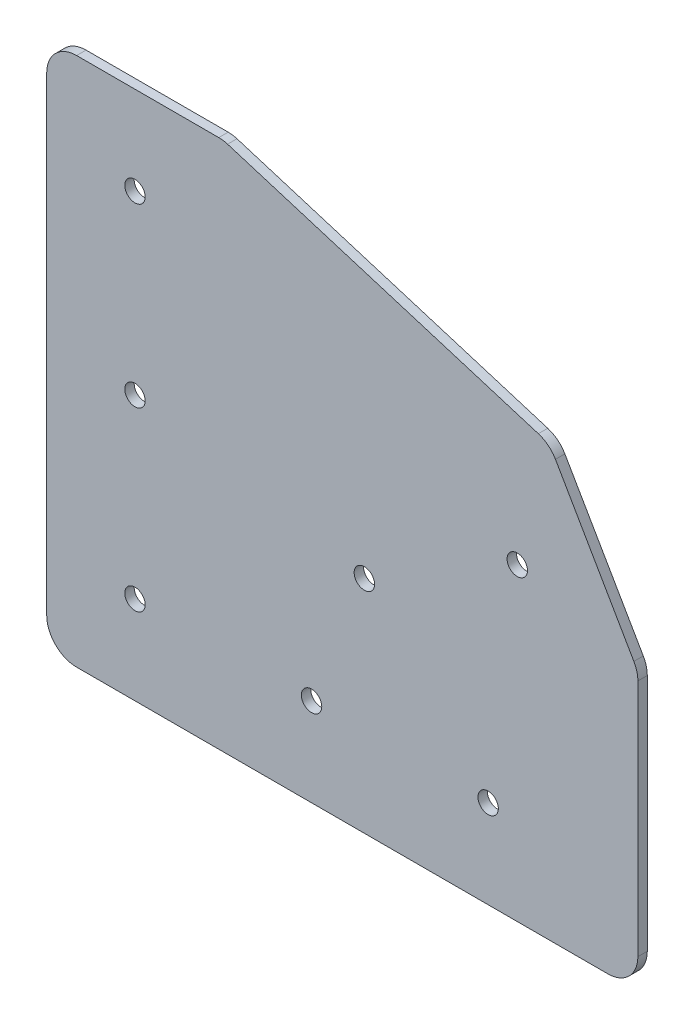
ISO-10303-21;
HEADER;
FILE_DESCRIPTION(('STEP AP214'),'2;1');
FILE_NAME('part.step','',(''),(''),'','','');
FILE_SCHEMA(('AUTOMOTIVE_DESIGN { 1 0 10303 214 1 1 1 1 }'));
ENDSEC;
DATA;
#1=APPLICATION_CONTEXT('core data for automotive mechanical design processes');
#2=APPLICATION_PROTOCOL_DEFINITION('international standard','automotive_design',2000,#1);
#3=PRODUCT_CONTEXT('',#1,'mechanical');
#4=PRODUCT('Part','Part','',(#3));
#5=PRODUCT_RELATED_PRODUCT_CATEGORY('part','',(#4));
#6=PRODUCT_DEFINITION_FORMATION('','',#4);
#7=PRODUCT_DEFINITION_CONTEXT('part definition',#1,'design');
#8=PRODUCT_DEFINITION('design','',#6,#7);
#9=PRODUCT_DEFINITION_SHAPE('','',#8);
#10=(LENGTH_UNIT() NAMED_UNIT(*) SI_UNIT(.MILLI.,.METRE.));
#11=(NAMED_UNIT(*) PLANE_ANGLE_UNIT() SI_UNIT($,.RADIAN.));
#12=(NAMED_UNIT(*) SI_UNIT($,.STERADIAN.) SOLID_ANGLE_UNIT());
#13=UNCERTAINTY_MEASURE_WITH_UNIT(LENGTH_MEASURE(1.E-05),#10,'distance_accuracy_value','');
#14=(GEOMETRIC_REPRESENTATION_CONTEXT(3) GLOBAL_UNCERTAINTY_ASSIGNED_CONTEXT((#13)) GLOBAL_UNIT_ASSIGNED_CONTEXT((#10,
#11,#12)) REPRESENTATION_CONTEXT('',''));
#15=CARTESIAN_POINT('',(0.,0.,0.));
#16=DIRECTION('',(0.,0.,1.));
#17=DIRECTION('',(1.,0.,0.));
#18=AXIS2_PLACEMENT_3D('',#15,#16,#17);
#19=CARTESIAN_POINT('',(95.6712777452,4.841875,1.524));
#20=DIRECTION('',(1.,0.,0.));
#21=DIRECTION('',(0.,0.,-1.));
#22=AXIS2_PLACEMENT_3D('',#19,#20,#21);
#23=PLANE('',#22);
#24=DIRECTION('',(0.,1.,0.));
#25=VECTOR('',#24,1.);
#26=CARTESIAN_POINT('',(95.6712777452,42.8625,1.524));
#27=LINE('',#26,#25);
#28=CARTESIAN_POINT('',(95.6712777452,4.84187499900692,1.524));
#29=VERTEX_POINT('',#28);
#30=CARTESIAN_POINT('',(95.6712777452,43.4792855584,1.524));
#31=VERTEX_POINT('',#30);
#32=EDGE_CURVE('E198',#29,#31,#27,.T.);
#33=ORIENTED_EDGE('',*,*,#32,.F.);
#34=DIRECTION('',(0.,0.,1.));
#35=VECTOR('',#34,1.);
#36=CARTESIAN_POINT('',(95.6712777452,4.84187499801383,0.762));
#37=LINE('',#36,#35);
#38=CARTESIAN_POINT('',(95.6712777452,4.84187499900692,0.));
#39=VERTEX_POINT('',#38);
#40=EDGE_CURVE('E128',#29,#39,#37,.F.);
#41=ORIENTED_EDGE('',*,*,#40,.T.);
#42=DIRECTION('',(0.,1.,0.));
#43=VECTOR('',#42,1.);
#44=CARTESIAN_POINT('',(95.6712777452,42.8625,0.));
#45=LINE('',#44,#43);
#46=CARTESIAN_POINT('',(95.6712777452,43.4792855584,0.));
#47=VERTEX_POINT('',#46);
#48=EDGE_CURVE('E222',#39,#47,#45,.T.);
#49=ORIENTED_EDGE('',*,*,#48,.T.);
#50=DIRECTION('',(0.,0.,-1.));
#51=VECTOR('',#50,1.);
#52=CARTESIAN_POINT('',(95.6712777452,43.4792855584,0.762));
#53=LINE('',#52,#51);
#54=EDGE_CURVE('E158',#47,#31,#53,.F.);
#55=ORIENTED_EDGE('',*,*,#54,.T.);
#56=EDGE_LOOP('',(#33,#41,#49,#55));
#57=FACE_BOUND('',#56,.T.);
#58=ADVANCED_FACE('F15',(#57),#23,.T.);
#59=CARTESIAN_POINT('',(90.8294027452,43.4792855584,0.));
#60=DIRECTION('',(0.,0.,1.));
#61=DIRECTION('',(1.,0.,0.));
#62=AXIS2_PLACEMENT_3D('',#59,#60,#61);
#63=CYLINDRICAL_SURFACE('',#62,4.841875);
#64=ORIENTED_EDGE('',*,*,#54,.F.);
#65=CARTESIAN_POINT('',(90.8294027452,43.4792855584,0.));
#66=DIRECTION('',(0.,0.,1.));
#67=DIRECTION('',(1.,0.,0.));
#68=AXIS2_PLACEMENT_3D('',#65,#66,#67);
#69=CIRCLE('',#68,4.841875);
#70=CARTESIAN_POINT('',(95.0225894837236,45.9002230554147,0.));
#71=VERTEX_POINT('',#70);
#72=EDGE_CURVE('E219',#47,#71,#69,.T.);
#73=ORIENTED_EDGE('',*,*,#72,.T.);
#74=DIRECTION('',(0.,0.,1.));
#75=VECTOR('',#74,1.);
#76=CARTESIAN_POINT('',(95.022589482,45.9002230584,0.762));
#77=LINE('',#76,#75);
#78=CARTESIAN_POINT('',(95.0225894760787,45.9002230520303,1.524));
#79=VERTEX_POINT('',#78);
#80=EDGE_CURVE('E155',#71,#79,#77,.T.);
#81=ORIENTED_EDGE('',*,*,#80,.T.);
#82=CARTESIAN_POINT('',(90.8294027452,43.4792855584,1.524));
#83=DIRECTION('',(0.,0.,1.));
#84=DIRECTION('',(1.,0.,0.));
#85=AXIS2_PLACEMENT_3D('',#82,#83,#84);
#86=CIRCLE('',#85,4.841875);
#87=EDGE_CURVE('E196',#31,#79,#86,.T.);
#88=ORIENTED_EDGE('',*,*,#87,.F.);
#89=EDGE_LOOP('',(#64,#73,#81,#88));
#90=FACE_BOUND('',#89,.T.);
#91=ADVANCED_FACE('F265',(#90),#63,.T.);
#92=CARTESIAN_POINT('',(82.3360453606,67.873962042,0.));
#93=DIRECTION('',(-0.866025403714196,-0.500000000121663,0.));
#94=DIRECTION('',(0.500000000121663,-0.866025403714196,0.));
#95=AXIS2_PLACEMENT_3D('',#92,#93,#94);
#96=PLANE('',#95);
#97=ORIENTED_EDGE('',*,*,#80,.F.);
#98=DIRECTION('',(0.500000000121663,-0.866025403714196,0.));
#99=VECTOR('',#98,1.);
#100=CARTESIAN_POINT('',(82.3360453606,67.873962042,0.));
#101=LINE('',#100,#99);
#102=CARTESIAN_POINT('',(82.3360453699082,67.8739620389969,0.));
#103=VERTEX_POINT('',#102);
#104=EDGE_CURVE('E217',#71,#103,#101,.F.);
#105=ORIENTED_EDGE('',*,*,#104,.T.);
#106=DIRECTION('',(0.,0.,-1.));
#107=VECTOR('',#106,1.);
#108=CARTESIAN_POINT('',(82.3360453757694,67.8739620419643,0.762));
#109=LINE('',#108,#107);
#110=CARTESIAN_POINT('',(82.3360453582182,67.8739620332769,1.524));
#111=VERTEX_POINT('',#110);
#112=EDGE_CURVE('E103',#103,#111,#109,.F.);
#113=ORIENTED_EDGE('',*,*,#112,.T.);
#114=DIRECTION('',(-0.500000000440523,0.866025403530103,0.));
#115=VECTOR('',#114,1.);
#116=CARTESIAN_POINT('',(95.0225894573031,45.900223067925,1.524));
#117=LINE('',#116,#115);
#118=EDGE_CURVE('E194',#79,#111,#117,.T.);
#119=ORIENTED_EDGE('',*,*,#118,.F.);
#120=EDGE_LOOP('',(#97,#105,#113,#119));
#121=FACE_BOUND('',#120,.T.);
#122=ADVANCED_FACE('F268',(#121),#96,.F.);
#123=CARTESIAN_POINT('',(78.1428586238,65.453024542,1.524));
#124=DIRECTION('',(0.,0.,-1.));
#125=DIRECTION('',(0.,1.,0.));
#126=AXIS2_PLACEMENT_3D('',#123,#124,#125);
#127=CYLINDRICAL_SURFACE('',#126,4.84187500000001);
#128=ORIENTED_EDGE('',*,*,#112,.F.);
#129=CARTESIAN_POINT('',(78.1428586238,65.453024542,0.));
#130=DIRECTION('',(0.,0.,-1.));
#131=DIRECTION('',(0.,1.,0.));
#132=AXIS2_PLACEMENT_3D('',#129,#130,#131);
#133=CIRCLE('',#132,4.84187500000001);
#134=CARTESIAN_POINT('',(79.5630061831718,70.0819482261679,0.));
#135=VERTEX_POINT('',#134);
#136=EDGE_CURVE('E19',#103,#135,#133,.F.);
#137=ORIENTED_EDGE('',*,*,#136,.T.);
#138=DIRECTION('',(0.,0.,1.));
#139=VECTOR('',#138,1.);
#140=CARTESIAN_POINT('',(79.5630061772,70.081948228,0.762));
#141=LINE('',#140,#139);
#142=CARTESIAN_POINT('',(79.563006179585,70.0819482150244,1.524));
#143=VERTEX_POINT('',#142);
#144=EDGE_CURVE('E110',#135,#143,#141,.T.);
#145=ORIENTED_EDGE('',*,*,#144,.T.);
#146=CARTESIAN_POINT('',(78.1428586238,65.453024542,1.524));
#147=DIRECTION('',(0.,0.,-1.));
#148=DIRECTION('',(0.,1.,0.));
#149=AXIS2_PLACEMENT_3D('',#146,#147,#148);
#150=CIRCLE('',#149,4.84187500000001);
#151=EDGE_CURVE('E192',#111,#143,#150,.F.);
#152=ORIENTED_EDGE('',*,*,#151,.F.);
#153=EDGE_LOOP('',(#128,#137,#145,#152));
#154=FACE_BOUND('',#153,.T.);
#155=ADVANCED_FACE('F127',(#154),#127,.T.);
#156=CARTESIAN_POINT('',(29.2691077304,85.512048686,0.));
#157=DIRECTION('',(-0.293305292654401,-0.956018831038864,0.));
#158=DIRECTION('',(0.956018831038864,-0.293305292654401,0.));
#159=AXIS2_PLACEMENT_3D('',#156,#157,#158);
#160=PLANE('',#159);
#161=ORIENTED_EDGE('',*,*,#144,.F.);
#162=DIRECTION('',(0.956018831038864,-0.293305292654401,0.));
#163=VECTOR('',#162,1.);
#164=CARTESIAN_POINT('',(29.2691077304,85.512048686,0.));
#165=LINE('',#164,#163);
#166=CARTESIAN_POINT('',(29.269107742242,85.5120486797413,0.));
#167=VERTEX_POINT('',#166);
#168=EDGE_CURVE('E114',#135,#167,#165,.F.);
#169=ORIENTED_EDGE('',*,*,#168,.T.);
#170=DIRECTION('',(0.,0.,-1.));
#171=VECTOR('',#170,1.);
#172=CARTESIAN_POINT('',(29.2691077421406,85.5120486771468,0.762));
#173=LINE('',#172,#171);
#174=CARTESIAN_POINT('',(29.2691077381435,85.5120486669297,1.524));
#175=VERTEX_POINT('',#174);
#176=EDGE_CURVE('E116',#167,#175,#173,.F.);
#177=ORIENTED_EDGE('',*,*,#176,.T.);
#178=DIRECTION('',(-0.956018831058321,0.293305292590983,0.));
#179=VECTOR('',#178,1.);
#180=CARTESIAN_POINT('',(79.5630061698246,70.081948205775,1.524));
#181=LINE('',#180,#179);
#182=EDGE_CURVE('E115',#143,#175,#181,.T.);
#183=ORIENTED_EDGE('',*,*,#182,.F.);
#184=EDGE_LOOP('',(#161,#169,#177,#183));
#185=FACE_BOUND('',#184,.T.);
#186=ADVANCED_FACE('F112',(#185),#160,.F.);
#187=CARTESIAN_POINT('',(27.848960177,80.883125,1.524));
#188=DIRECTION('',(0.,0.,-1.));
#189=DIRECTION('',(0.,1.,0.));
#190=AXIS2_PLACEMENT_3D('',#187,#188,#189);
#191=CYLINDRICAL_SURFACE('',#190,4.841875);
#192=ORIENTED_EDGE('',*,*,#176,.F.);
#193=CARTESIAN_POINT('',(27.848960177,80.883125,0.));
#194=DIRECTION('',(0.,0.,-1.));
#195=DIRECTION('',(0.,1.,0.));
#196=AXIS2_PLACEMENT_3D('',#193,#194,#195);
#197=CIRCLE('',#196,4.841875);
#198=CARTESIAN_POINT('',(27.848960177,85.725,0.));
#199=VERTEX_POINT('',#198);
#200=EDGE_CURVE('E126',#167,#199,#197,.F.);
#201=ORIENTED_EDGE('',*,*,#200,.T.);
#202=DIRECTION('',(0.,0.,1.));
#203=VECTOR('',#202,1.);
#204=CARTESIAN_POINT('',(27.848960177,85.725,0.762));
#205=LINE('',#204,#203);
#206=CARTESIAN_POINT('',(27.848960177,85.725,1.524));
#207=VERTEX_POINT('',#206);
#208=EDGE_CURVE('E150',#199,#207,#205,.T.);
#209=ORIENTED_EDGE('',*,*,#208,.T.);
#210=CARTESIAN_POINT('',(27.848960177,80.883125,1.524));
#211=DIRECTION('',(0.,0.,-1.));
#212=DIRECTION('',(0.,1.,0.));
#213=AXIS2_PLACEMENT_3D('',#210,#211,#212);
#214=CIRCLE('',#213,4.841875);
#215=EDGE_CURVE('E189',#175,#207,#214,.F.);
#216=ORIENTED_EDGE('',*,*,#215,.F.);
#217=EDGE_LOOP('',(#192,#201,#209,#216));
#218=FACE_BOUND('',#217,.T.);
#219=ADVANCED_FACE('F275',(#218),#191,.T.);
#220=CARTESIAN_POINT('',(4.841875,85.725,0.));
#221=DIRECTION('',(0.,-1.,0.));
#222=DIRECTION('',(1.,0.,0.));
#223=AXIS2_PLACEMENT_3D('',#220,#221,#222);
#224=PLANE('',#223);
#225=ORIENTED_EDGE('',*,*,#208,.F.);
#226=DIRECTION('',(-1.,0.,0.));
#227=VECTOR('',#226,1.);
#228=CARTESIAN_POINT('',(47.8356388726,85.725,0.));
#229=LINE('',#228,#227);
#230=CARTESIAN_POINT('',(4.84187500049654,85.725,0.));
#231=VERTEX_POINT('',#230);
#232=EDGE_CURVE('E234',#199,#231,#229,.T.);
#233=ORIENTED_EDGE('',*,*,#232,.T.);
#234=DIRECTION('',(0.,0.,-1.));
#235=VECTOR('',#234,1.);
#236=CARTESIAN_POINT('',(4.84187500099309,85.725,0.762));
#237=LINE('',#236,#235);
#238=CARTESIAN_POINT('',(4.84187500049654,85.725,1.524));
#239=VERTEX_POINT('',#238);
#240=EDGE_CURVE('E147',#231,#239,#237,.F.);
#241=ORIENTED_EDGE('',*,*,#240,.T.);
#242=DIRECTION('',(-1.,0.,0.));
#243=VECTOR('',#242,1.);
#244=CARTESIAN_POINT('',(47.8356388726,85.725,1.524));
#245=LINE('',#244,#243);
#246=EDGE_CURVE('E188',#207,#239,#245,.T.);
#247=ORIENTED_EDGE('',*,*,#246,.F.);
#248=EDGE_LOOP('',(#225,#233,#241,#247));
#249=FACE_BOUND('',#248,.T.);
#250=ADVANCED_FACE('F273',(#249),#224,.F.);
#251=CARTESIAN_POINT('',(4.841875,80.883125,1.524));
#252=DIRECTION('',(0.,0.,-1.));
#253=DIRECTION('',(0.,1.,0.));
#254=AXIS2_PLACEMENT_3D('',#251,#252,#253);
#255=CYLINDRICAL_SURFACE('',#254,4.841875);
#256=ORIENTED_EDGE('',*,*,#240,.F.);
#257=CARTESIAN_POINT('',(4.841875,80.883125,0.));
#258=DIRECTION('',(0.,0.,-1.));
#259=DIRECTION('',(0.,1.,0.));
#260=AXIS2_PLACEMENT_3D('',#257,#258,#259);
#261=CIRCLE('',#260,4.841875);
#262=CARTESIAN_POINT('',(0.,80.883125,0.));
#263=VERTEX_POINT('',#262);
#264=EDGE_CURVE('E231',#231,#263,#261,.F.);
#265=ORIENTED_EDGE('',*,*,#264,.T.);
#266=DIRECTION('',(0.,0.,1.));
#267=VECTOR('',#266,1.);
#268=CARTESIAN_POINT('',(0.,80.883125,0.762));
#269=LINE('',#268,#267);
#270=CARTESIAN_POINT('',(0.,80.883125,1.524));
#271=VERTEX_POINT('',#270);
#272=EDGE_CURVE('E144',#263,#271,#269,.T.);
#273=ORIENTED_EDGE('',*,*,#272,.T.);
#274=CARTESIAN_POINT('',(4.841875,80.883125,1.524));
#275=DIRECTION('',(0.,0.,-1.));
#276=DIRECTION('',(0.,1.,0.));
#277=AXIS2_PLACEMENT_3D('',#274,#275,#276);
#278=CIRCLE('',#277,4.841875);
#279=EDGE_CURVE('E186',#239,#271,#278,.F.);
#280=ORIENTED_EDGE('',*,*,#279,.F.);
#281=EDGE_LOOP('',(#256,#265,#273,#280));
#282=FACE_BOUND('',#281,.T.);
#283=ADVANCED_FACE('F271',(#282),#255,.T.);
#284=CARTESIAN_POINT('',(0.,4.841875,0.));
#285=DIRECTION('',(1.,0.,0.));
#286=DIRECTION('',(0.,1.,0.));
#287=AXIS2_PLACEMENT_3D('',#284,#285,#286);
#288=PLANE('',#287);
#289=DIRECTION('',(0.,0.,-1.));
#290=VECTOR('',#289,1.);
#291=CARTESIAN_POINT('',(0.,4.84187499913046,0.762));
#292=LINE('',#291,#290);
#293=CARTESIAN_POINT('',(0.,4.84187499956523,0.));
#294=VERTEX_POINT('',#293);
#295=CARTESIAN_POINT('',(0.,4.84187499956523,1.524));
#296=VERTEX_POINT('',#295);
#297=EDGE_CURVE('E141',#294,#296,#292,.F.);
#298=ORIENTED_EDGE('',*,*,#297,.T.);
#299=DIRECTION('',(0.,-1.,0.));
#300=VECTOR('',#299,1.);
#301=CARTESIAN_POINT('',(0.,42.8625,1.524));
#302=LINE('',#301,#300);
#303=EDGE_CURVE('E185',#271,#296,#302,.T.);
#304=ORIENTED_EDGE('',*,*,#303,.F.);
#305=ORIENTED_EDGE('',*,*,#272,.F.);
#306=DIRECTION('',(0.,-1.,0.));
#307=VECTOR('',#306,1.);
#308=CARTESIAN_POINT('',(0.,42.8625,0.));
#309=LINE('',#308,#307);
#310=EDGE_CURVE('E230',#263,#294,#309,.T.);
#311=ORIENTED_EDGE('',*,*,#310,.T.);
#312=EDGE_LOOP('',(#298,#304,#305,#311));
#313=FACE_BOUND('',#312,.T.);
#314=ADVANCED_FACE('F251',(#313),#288,.F.);
#315=CARTESIAN_POINT('',(4.841875,4.841875,1.524));
#316=DIRECTION('',(0.,0.,-1.));
#317=DIRECTION('',(0.,1.,0.));
#318=AXIS2_PLACEMENT_3D('',#315,#316,#317);
#319=CYLINDRICAL_SURFACE('',#318,4.841875);
#320=ORIENTED_EDGE('',*,*,#297,.F.);
#321=CARTESIAN_POINT('',(4.841875,4.841875,0.));
#322=DIRECTION('',(0.,0.,-1.));
#323=DIRECTION('',(0.,1.,0.));
#324=AXIS2_PLACEMENT_3D('',#321,#322,#323);
#325=CIRCLE('',#324,4.841875);
#326=CARTESIAN_POINT('',(4.841875,0.,0.));
#327=VERTEX_POINT('',#326);
#328=EDGE_CURVE('E227',#294,#327,#325,.F.);
#329=ORIENTED_EDGE('',*,*,#328,.T.);
#330=DIRECTION('',(0.,0.,1.));
#331=VECTOR('',#330,1.);
#332=CARTESIAN_POINT('',(4.841875,0.,0.762));
#333=LINE('',#332,#331);
#334=CARTESIAN_POINT('',(4.841875,0.,1.524));
#335=VERTEX_POINT('',#334);
#336=EDGE_CURVE('E135',#327,#335,#333,.T.);
#337=ORIENTED_EDGE('',*,*,#336,.T.);
#338=CARTESIAN_POINT('',(4.841875,4.841875,1.524));
#339=DIRECTION('',(0.,0.,-1.));
#340=DIRECTION('',(0.,1.,0.));
#341=AXIS2_PLACEMENT_3D('',#338,#339,#340);
#342=CIRCLE('',#341,4.841875);
#343=EDGE_CURVE('E183',#296,#335,#342,.F.);
#344=ORIENTED_EDGE('',*,*,#343,.F.);
#345=EDGE_LOOP('',(#320,#329,#337,#344));
#346=FACE_BOUND('',#345,.T.);
#347=ADVANCED_FACE('F255',(#346),#319,.T.);
#348=CARTESIAN_POINT('',(4.841875,0.,0.));
#349=DIRECTION('',(0.,1.,0.));
#350=DIRECTION('',(0.,0.,1.));
#351=AXIS2_PLACEMENT_3D('',#348,#349,#350);
#352=PLANE('',#351);
#353=DIRECTION('',(0.,0.,-1.));
#354=VECTOR('',#353,1.);
#355=CARTESIAN_POINT('',(90.8294027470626,0.,0.762));
#356=LINE('',#355,#354);
#357=CARTESIAN_POINT('',(90.8294027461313,0.,0.));
#358=VERTEX_POINT('',#357);
#359=CARTESIAN_POINT('',(90.8294027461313,0.,1.524));
#360=VERTEX_POINT('',#359);
#361=EDGE_CURVE('E129',#358,#360,#356,.F.);
#362=ORIENTED_EDGE('',*,*,#361,.T.);
#363=DIRECTION('',(1.,0.,0.));
#364=VECTOR('',#363,1.);
#365=CARTESIAN_POINT('',(47.8356388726,0.,1.524));
#366=LINE('',#365,#364);
#367=EDGE_CURVE('E34',#335,#360,#366,.T.);
#368=ORIENTED_EDGE('',*,*,#367,.F.);
#369=ORIENTED_EDGE('',*,*,#336,.F.);
#370=DIRECTION('',(1.,0.,0.));
#371=VECTOR('',#370,1.);
#372=CARTESIAN_POINT('',(47.8356388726,0.,0.));
#373=LINE('',#372,#371);
#374=EDGE_CURVE('E226',#327,#358,#373,.T.);
#375=ORIENTED_EDGE('',*,*,#374,.T.);
#376=EDGE_LOOP('',(#362,#368,#369,#375));
#377=FACE_BOUND('',#376,.T.);
#378=ADVANCED_FACE('F258',(#377),#352,.F.);
#379=CARTESIAN_POINT('',(90.8294027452,4.841875,1.524));
#380=DIRECTION('',(0.,0.,-1.));
#381=DIRECTION('',(0.,1.,0.));
#382=AXIS2_PLACEMENT_3D('',#379,#380,#381);
#383=CYLINDRICAL_SURFACE('',#382,4.84187500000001);
#384=ORIENTED_EDGE('',*,*,#40,.F.);
#385=CARTESIAN_POINT('',(90.8294027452,4.841875,1.524));
#386=DIRECTION('',(0.,0.,-1.));
#387=DIRECTION('',(0.,1.,0.));
#388=AXIS2_PLACEMENT_3D('',#385,#386,#387);
#389=CIRCLE('',#388,4.84187500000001);
#390=EDGE_CURVE('E181',#360,#29,#389,.F.);
#391=ORIENTED_EDGE('',*,*,#390,.F.);
#392=ORIENTED_EDGE('',*,*,#361,.F.);
#393=CARTESIAN_POINT('',(90.8294027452,4.841875,0.));
#394=DIRECTION('',(0.,0.,-1.));
#395=DIRECTION('',(0.,1.,0.));
#396=AXIS2_PLACEMENT_3D('',#393,#394,#395);
#397=CIRCLE('',#396,4.84187500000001);
#398=EDGE_CURVE('E223',#358,#39,#397,.F.);
#399=ORIENTED_EDGE('',*,*,#398,.T.);
#400=EDGE_LOOP('',(#384,#391,#392,#399));
#401=FACE_BOUND('',#400,.T.);
#402=ADVANCED_FACE('F262',(#401),#383,.T.);
#403=CARTESIAN_POINT('',(76.1541897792,50.00625,0.));
#404=DIRECTION('',(0.,0.,1.));
#405=DIRECTION('',(1.,0.,0.));
#406=AXIS2_PLACEMENT_3D('',#403,#404,#405);
#407=CYLINDRICAL_SURFACE('',#406,1.651);
#408=CARTESIAN_POINT('',(76.1541897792,50.00625,1.524));
#409=DIRECTION('',(0.,0.,1.));
#410=DIRECTION('',(1.,0.,0.));
#411=AXIS2_PLACEMENT_3D('',#408,#409,#410);
#412=CIRCLE('',#411,1.651);
#413=CARTESIAN_POINT('',(77.8051897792,50.00625,1.524));
#414=VERTEX_POINT('',#413);
#415=EDGE_CURVE('E178',#414,#414,#412,.F.);
#416=ORIENTED_EDGE('',*,*,#415,.F.);
#417=EDGE_LOOP('',(#416));
#418=FACE_BOUND('',#417,.T.);
#419=CARTESIAN_POINT('',(76.1541897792,50.00625,0.));
#420=DIRECTION('',(0.,0.,1.));
#421=DIRECTION('',(1.,0.,0.));
#422=AXIS2_PLACEMENT_3D('',#419,#420,#421);
#423=CIRCLE('',#422,1.651);
#424=CARTESIAN_POINT('',(77.8051897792,50.00625,0.));
#425=VERTEX_POINT('',#424);
#426=EDGE_CURVE('E214',#425,#425,#423,.F.);
#427=ORIENTED_EDGE('',*,*,#426,.T.);
#428=EDGE_LOOP('',(#427));
#429=FACE_BOUND('',#428,.T.);
#430=ADVANCED_FACE('F316',(#418,#429),#407,.F.);
#431=CARTESIAN_POINT('',(51.4075138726,35.71875,0.));
#432=DIRECTION('',(0.,0.,1.));
#433=DIRECTION('',(1.,0.,0.));
#434=AXIS2_PLACEMENT_3D('',#431,#432,#433);
#435=CYLINDRICAL_SURFACE('',#434,1.651);
#436=CARTESIAN_POINT('',(51.4075138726,35.71875,1.524));
#437=DIRECTION('',(0.,0.,1.));
#438=DIRECTION('',(1.,0.,0.));
#439=AXIS2_PLACEMENT_3D('',#436,#437,#438);
#440=CIRCLE('',#439,1.651);
#441=CARTESIAN_POINT('',(53.0585138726,35.71875,1.524));
#442=VERTEX_POINT('',#441);
#443=EDGE_CURVE('E175',#442,#442,#440,.F.);
#444=ORIENTED_EDGE('',*,*,#443,.F.);
#445=EDGE_LOOP('',(#444));
#446=FACE_BOUND('',#445,.T.);
#447=CARTESIAN_POINT('',(51.4075138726,35.71875,0.));
#448=DIRECTION('',(0.,0.,1.));
#449=DIRECTION('',(1.,0.,0.));
#450=AXIS2_PLACEMENT_3D('',#447,#448,#449);
#451=CIRCLE('',#450,1.651);
#452=CARTESIAN_POINT('',(53.0585138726,35.71875,0.));
#453=VERTEX_POINT('',#452);
#454=EDGE_CURVE('E211',#453,#453,#451,.F.);
#455=ORIENTED_EDGE('',*,*,#454,.T.);
#456=EDGE_LOOP('',(#455));
#457=FACE_BOUND('',#456,.T.);
#458=ADVANCED_FACE('F312',(#446,#457),#435,.F.);
#459=CARTESIAN_POINT('',(71.4375,14.2875,0.));
#460=DIRECTION('',(0.,0.,1.));
#461=DIRECTION('',(1.,0.,0.));
#462=AXIS2_PLACEMENT_3D('',#459,#460,#461);
#463=CYLINDRICAL_SURFACE('',#462,1.651);
#464=CARTESIAN_POINT('',(71.4375,14.2875,1.524));
#465=DIRECTION('',(0.,0.,1.));
#466=DIRECTION('',(1.,0.,0.));
#467=AXIS2_PLACEMENT_3D('',#464,#465,#466);
#468=CIRCLE('',#467,1.651);
#469=CARTESIAN_POINT('',(73.0885,14.2875,1.524));
#470=VERTEX_POINT('',#469);
#471=EDGE_CURVE('E172',#470,#470,#468,.F.);
#472=ORIENTED_EDGE('',*,*,#471,.F.);
#473=EDGE_LOOP('',(#472));
#474=FACE_BOUND('',#473,.T.);
#475=CARTESIAN_POINT('',(71.4375,14.2875,0.));
#476=DIRECTION('',(0.,0.,1.));
#477=DIRECTION('',(1.,0.,0.));
#478=AXIS2_PLACEMENT_3D('',#475,#476,#477);
#479=CIRCLE('',#478,1.651);
#480=CARTESIAN_POINT('',(73.0885,14.2875,0.));
#481=VERTEX_POINT('',#480);
#482=EDGE_CURVE('E208',#481,#481,#479,.F.);
#483=ORIENTED_EDGE('',*,*,#482,.T.);
#484=EDGE_LOOP('',(#483));
#485=FACE_BOUND('',#484,.T.);
#486=ADVANCED_FACE('F308',(#474,#485),#463,.F.);
#487=CARTESIAN_POINT('',(14.2875,14.2875,0.));
#488=DIRECTION('',(0.,0.,1.));
#489=DIRECTION('',(1.,0.,0.));
#490=AXIS2_PLACEMENT_3D('',#487,#488,#489);
#491=CYLINDRICAL_SURFACE('',#490,1.651);
#492=CARTESIAN_POINT('',(14.2875,14.2875,1.524));
#493=DIRECTION('',(0.,0.,1.));
#494=DIRECTION('',(1.,0.,0.));
#495=AXIS2_PLACEMENT_3D('',#492,#493,#494);
#496=CIRCLE('',#495,1.651);
#497=CARTESIAN_POINT('',(15.9385,14.2875,1.524));
#498=VERTEX_POINT('',#497);
#499=EDGE_CURVE('E169',#498,#498,#496,.F.);
#500=ORIENTED_EDGE('',*,*,#499,.F.);
#501=EDGE_LOOP('',(#500));
#502=FACE_BOUND('',#501,.T.);
#503=CARTESIAN_POINT('',(14.2875,14.2875,0.));
#504=DIRECTION('',(0.,0.,1.));
#505=DIRECTION('',(1.,0.,0.));
#506=AXIS2_PLACEMENT_3D('',#503,#504,#505);
#507=CIRCLE('',#506,1.651);
#508=CARTESIAN_POINT('',(15.9385,14.2875,0.));
#509=VERTEX_POINT('',#508);
#510=EDGE_CURVE('E205',#509,#509,#507,.F.);
#511=ORIENTED_EDGE('',*,*,#510,.T.);
#512=EDGE_LOOP('',(#511));
#513=FACE_BOUND('',#512,.T.);
#514=ADVANCED_FACE('F304',(#502,#513),#491,.F.);
#515=CARTESIAN_POINT('',(14.2875,42.8625,0.));
#516=DIRECTION('',(0.,0.,1.));
#517=DIRECTION('',(1.,0.,0.));
#518=AXIS2_PLACEMENT_3D('',#515,#516,#517);
#519=CYLINDRICAL_SURFACE('',#518,1.651);
#520=CARTESIAN_POINT('',(14.2875,42.8625,1.524));
#521=DIRECTION('',(0.,0.,1.));
#522=DIRECTION('',(1.,0.,0.));
#523=AXIS2_PLACEMENT_3D('',#520,#521,#522);
#524=CIRCLE('',#523,1.651);
#525=CARTESIAN_POINT('',(15.9385,42.8625,1.524));
#526=VERTEX_POINT('',#525);
#527=EDGE_CURVE('E166',#526,#526,#524,.F.);
#528=ORIENTED_EDGE('',*,*,#527,.F.);
#529=EDGE_LOOP('',(#528));
#530=FACE_BOUND('',#529,.T.);
#531=CARTESIAN_POINT('',(14.2875,42.8625,0.));
#532=DIRECTION('',(0.,0.,1.));
#533=DIRECTION('',(1.,0.,0.));
#534=AXIS2_PLACEMENT_3D('',#531,#532,#533);
#535=CIRCLE('',#534,1.651);
#536=CARTESIAN_POINT('',(15.9385,42.8625,0.));
#537=VERTEX_POINT('',#536);
#538=EDGE_CURVE('E202',#537,#537,#535,.F.);
#539=ORIENTED_EDGE('',*,*,#538,.T.);
#540=EDGE_LOOP('',(#539));
#541=FACE_BOUND('',#540,.T.);
#542=ADVANCED_FACE('F300',(#530,#541),#519,.F.);
#543=CARTESIAN_POINT('',(14.2875,71.4375,0.));
#544=DIRECTION('',(0.,0.,1.));
#545=DIRECTION('',(1.,0.,0.));
#546=AXIS2_PLACEMENT_3D('',#543,#544,#545);
#547=CYLINDRICAL_SURFACE('',#546,1.651);
#548=CARTESIAN_POINT('',(14.2875,71.4375,1.524));
#549=DIRECTION('',(0.,0.,1.));
#550=DIRECTION('',(1.,0.,0.));
#551=AXIS2_PLACEMENT_3D('',#548,#549,#550);
#552=CIRCLE('',#551,1.651);
#553=CARTESIAN_POINT('',(15.9385,71.4375,1.524));
#554=VERTEX_POINT('',#553);
#555=EDGE_CURVE('E163',#554,#554,#552,.F.);
#556=ORIENTED_EDGE('',*,*,#555,.F.);
#557=EDGE_LOOP('',(#556));
#558=FACE_BOUND('',#557,.T.);
#559=CARTESIAN_POINT('',(14.2875,71.4375,0.));
#560=DIRECTION('',(0.,0.,1.));
#561=DIRECTION('',(1.,0.,0.));
#562=AXIS2_PLACEMENT_3D('',#559,#560,#561);
#563=CIRCLE('',#562,1.651);
#564=CARTESIAN_POINT('',(15.9385,71.4375,0.));
#565=VERTEX_POINT('',#564);
#566=EDGE_CURVE('E199',#565,#565,#563,.F.);
#567=ORIENTED_EDGE('',*,*,#566,.T.);
#568=EDGE_LOOP('',(#567));
#569=FACE_BOUND('',#568,.T.);
#570=ADVANCED_FACE('F297',(#558,#569),#547,.F.);
#571=CARTESIAN_POINT('',(0.,0.,0.));
#572=DIRECTION('',(0.,0.,1.));
#573=DIRECTION('',(1.,0.,0.));
#574=AXIS2_PLACEMENT_3D('',#571,#572,#573);
#575=PLANE('',#574);
#576=ORIENTED_EDGE('',*,*,#566,.F.);
#577=EDGE_LOOP('',(#576));
#578=FACE_BOUND('',#577,.T.);
#579=ORIENTED_EDGE('',*,*,#538,.F.);
#580=EDGE_LOOP('',(#579));
#581=FACE_BOUND('',#580,.T.);
#582=ORIENTED_EDGE('',*,*,#510,.F.);
#583=EDGE_LOOP('',(#582));
#584=FACE_BOUND('',#583,.T.);
#585=ORIENTED_EDGE('',*,*,#482,.F.);
#586=EDGE_LOOP('',(#585));
#587=FACE_BOUND('',#586,.T.);
#588=ORIENTED_EDGE('',*,*,#454,.F.);
#589=EDGE_LOOP('',(#588));
#590=FACE_BOUND('',#589,.T.);
#591=ORIENTED_EDGE('',*,*,#426,.F.);
#592=EDGE_LOOP('',(#591));
#593=FACE_BOUND('',#592,.T.);
#594=CARTESIAN_POINT('',(42.8625,14.2875,0.));
#595=DIRECTION('',(0.,0.,1.));
#596=DIRECTION('',(1.,0.,0.));
#597=AXIS2_PLACEMENT_3D('',#594,#595,#596);
#598=CIRCLE('',#597,1.65100000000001);
#599=CARTESIAN_POINT('',(44.5135,14.2875,0.));
#600=VERTEX_POINT('',#599);
#601=EDGE_CURVE('E25',#600,#600,#598,.F.);
#602=ORIENTED_EDGE('',*,*,#601,.F.);
#603=EDGE_LOOP('',(#602));
#604=FACE_BOUND('',#603,.T.);
#605=ORIENTED_EDGE('',*,*,#72,.F.);
#606=ORIENTED_EDGE('',*,*,#48,.F.);
#607=ORIENTED_EDGE('',*,*,#398,.F.);
#608=ORIENTED_EDGE('',*,*,#374,.F.);
#609=ORIENTED_EDGE('',*,*,#328,.F.);
#610=ORIENTED_EDGE('',*,*,#310,.F.);
#611=ORIENTED_EDGE('',*,*,#264,.F.);
#612=ORIENTED_EDGE('',*,*,#232,.F.);
#613=ORIENTED_EDGE('',*,*,#200,.F.);
#614=ORIENTED_EDGE('',*,*,#168,.F.);
#615=ORIENTED_EDGE('',*,*,#136,.F.);
#616=ORIENTED_EDGE('',*,*,#104,.F.);
#617=EDGE_LOOP('',(#605,#606,#607,#608,#609,#610,#611,#612,#613,#614,#615,#616));
#618=FACE_BOUND('',#617,.T.);
#619=ADVANCED_FACE('F121',(#578,#581,#584,#587,#590,#593,#604,#618),#575,.F.);
#620=CARTESIAN_POINT('',(0.,0.,1.524));
#621=DIRECTION('',(0.,0.,1.));
#622=DIRECTION('',(1.,0.,0.));
#623=AXIS2_PLACEMENT_3D('',#620,#621,#622);
#624=PLANE('',#623);
#625=ORIENTED_EDGE('',*,*,#555,.T.);
#626=EDGE_LOOP('',(#625));
#627=FACE_BOUND('',#626,.T.);
#628=ORIENTED_EDGE('',*,*,#527,.T.);
#629=EDGE_LOOP('',(#628));
#630=FACE_BOUND('',#629,.T.);
#631=ORIENTED_EDGE('',*,*,#499,.T.);
#632=EDGE_LOOP('',(#631));
#633=FACE_BOUND('',#632,.T.);
#634=ORIENTED_EDGE('',*,*,#471,.T.);
#635=EDGE_LOOP('',(#634));
#636=FACE_BOUND('',#635,.T.);
#637=ORIENTED_EDGE('',*,*,#443,.T.);
#638=EDGE_LOOP('',(#637));
#639=FACE_BOUND('',#638,.T.);
#640=ORIENTED_EDGE('',*,*,#415,.T.);
#641=EDGE_LOOP('',(#640));
#642=FACE_BOUND('',#641,.T.);
#643=CARTESIAN_POINT('',(42.8625,14.2875,1.524));
#644=DIRECTION('',(0.,0.,1.));
#645=DIRECTION('',(1.,0.,0.));
#646=AXIS2_PLACEMENT_3D('',#643,#644,#645);
#647=CIRCLE('',#646,1.65100000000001);
#648=CARTESIAN_POINT('',(44.5135,14.2875,1.524));
#649=VERTEX_POINT('',#648);
#650=EDGE_CURVE('E9',#649,#649,#647,.T.);
#651=ORIENTED_EDGE('',*,*,#650,.F.);
#652=EDGE_LOOP('',(#651));
#653=FACE_BOUND('',#652,.T.);
#654=ORIENTED_EDGE('',*,*,#367,.T.);
#655=ORIENTED_EDGE('',*,*,#390,.T.);
#656=ORIENTED_EDGE('',*,*,#32,.T.);
#657=ORIENTED_EDGE('',*,*,#87,.T.);
#658=ORIENTED_EDGE('',*,*,#118,.T.);
#659=ORIENTED_EDGE('',*,*,#151,.T.);
#660=ORIENTED_EDGE('',*,*,#182,.T.);
#661=ORIENTED_EDGE('',*,*,#215,.T.);
#662=ORIENTED_EDGE('',*,*,#246,.T.);
#663=ORIENTED_EDGE('',*,*,#279,.T.);
#664=ORIENTED_EDGE('',*,*,#303,.T.);
#665=ORIENTED_EDGE('',*,*,#343,.T.);
#666=EDGE_LOOP('',(#654,#655,#656,#657,#658,#659,#660,#661,#662,#663,#664,#665));
#667=FACE_BOUND('',#666,.T.);
#668=ADVANCED_FACE('F17',(#627,#630,#633,#636,#639,#642,#653,#667),#624,.T.);
#669=CARTESIAN_POINT('',(42.8625,14.2875,0.));
#670=DIRECTION('',(0.,0.,1.));
#671=DIRECTION('',(1.,0.,0.));
#672=AXIS2_PLACEMENT_3D('',#669,#670,#671);
#673=CYLINDRICAL_SURFACE('',#672,1.65100000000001);
#674=ORIENTED_EDGE('',*,*,#601,.T.);
#675=EDGE_LOOP('',(#674));
#676=FACE_BOUND('',#675,.T.);
#677=ORIENTED_EDGE('',*,*,#650,.T.);
#678=EDGE_LOOP('',(#677));
#679=FACE_BOUND('',#678,.T.);
#680=ADVANCED_FACE('F287',(#676,#679),#673,.F.);
#681=CLOSED_SHELL('',(#58,#91,#122,#155,#186,#219,#250,#283,#314,#347,#378,#402,#430,#458,#486,
#514,#542,#570,#619,#668,#680));
#682=MANIFOLD_SOLID_BREP('B1',#681);
#683=ADVANCED_BREP_SHAPE_REPRESENTATION('',(#18,#682),#14);
#684=SHAPE_DEFINITION_REPRESENTATION(#9,#683);
ENDSEC;
END-ISO-10303-21;
